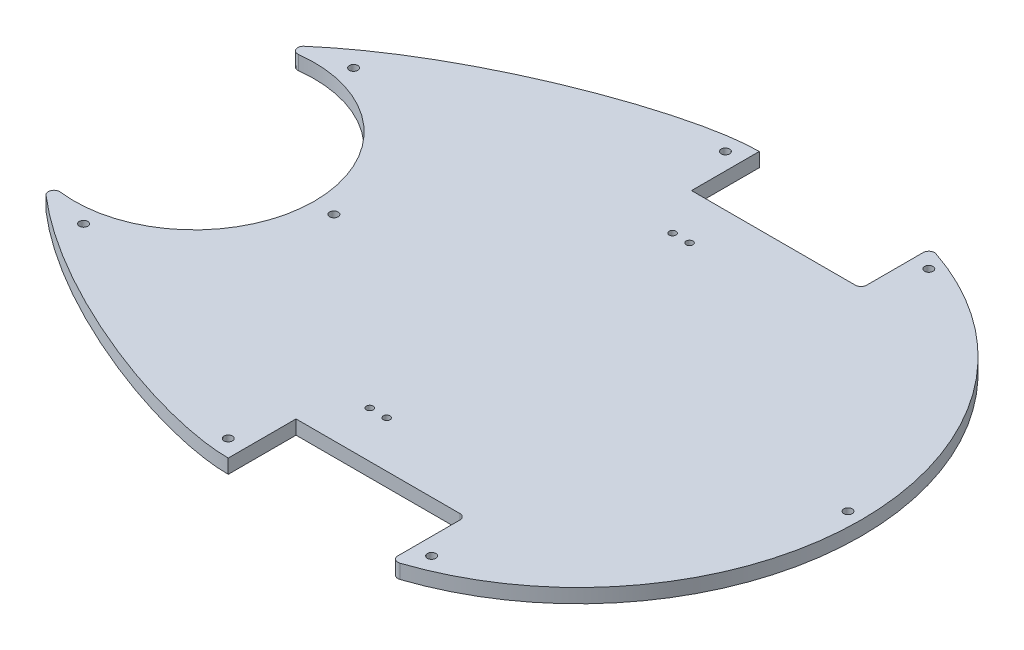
ISO-10303-21;
HEADER;
FILE_DESCRIPTION(('STEP AP214'),'2;1');
FILE_NAME('part.step','',(''),(''),'','','');
FILE_SCHEMA(('AUTOMOTIVE_DESIGN { 1 0 10303 214 1 1 1 1 }'));
ENDSEC;
DATA;
#1=APPLICATION_CONTEXT('core data for automotive mechanical design processes');
#2=APPLICATION_PROTOCOL_DEFINITION('international standard','automotive_design',2000,#1);
#3=PRODUCT_CONTEXT('',#1,'mechanical');
#4=PRODUCT('Part','Part','',(#3));
#5=PRODUCT_RELATED_PRODUCT_CATEGORY('part','',(#4));
#6=PRODUCT_DEFINITION_FORMATION('','',#4);
#7=PRODUCT_DEFINITION_CONTEXT('part definition',#1,'design');
#8=PRODUCT_DEFINITION('design','',#6,#7);
#9=PRODUCT_DEFINITION_SHAPE('','',#8);
#10=(LENGTH_UNIT() NAMED_UNIT(*) SI_UNIT(.MILLI.,.METRE.));
#11=(NAMED_UNIT(*) PLANE_ANGLE_UNIT() SI_UNIT($,.RADIAN.));
#12=(NAMED_UNIT(*) SI_UNIT($,.STERADIAN.) SOLID_ANGLE_UNIT());
#13=UNCERTAINTY_MEASURE_WITH_UNIT(LENGTH_MEASURE(1.E-05),#10,'distance_accuracy_value','');
#14=(GEOMETRIC_REPRESENTATION_CONTEXT(3) GLOBAL_UNCERTAINTY_ASSIGNED_CONTEXT((#13)) GLOBAL_UNIT_ASSIGNED_CONTEXT((#10,
#11,#12)) REPRESENTATION_CONTEXT('',''));
#15=CARTESIAN_POINT('',(0.,0.,0.));
#16=DIRECTION('',(0.,0.,1.));
#17=DIRECTION('',(1.,0.,0.));
#18=AXIS2_PLACEMENT_3D('',#15,#16,#17);
#19=CARTESIAN_POINT('',(37.4360125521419,6.35,-129.794919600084));
#20=CARTESIAN_POINT('',(-26.0639874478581,6.35,-129.794919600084));
#21=CARTESIAN_POINT('',(-212.753987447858,6.35,-40.894919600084));
#22=CARTESIAN_POINT('',(-212.753987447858,6.35,20.065080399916));
#23=CARTESIAN_POINT('',(-26.063987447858,6.35,108.965080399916));
#24=CARTESIAN_POINT('',(37.436012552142,6.35,108.965080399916));
#25=B_SPLINE_CURVE_WITH_KNOTS('',5,(#19,#20,#21,#22,#23,#24),.UNSPECIFIED.,.F.,.F.,(6,6),(0.,
1.),.UNSPECIFIED.);
#26=DIRECTION('',(0.,-1.,0.));
#27=VECTOR('',#26,1.);
#28=SURFACE_OF_LINEAR_EXTRUSION('',#25,#27);
#29=CARTESIAN_POINT('',(37.4360125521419,0.,-129.794919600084));
#30=CARTESIAN_POINT('',(-26.0639874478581,0.,-129.794919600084));
#31=CARTESIAN_POINT('',(-212.753987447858,0.,-40.894919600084));
#32=CARTESIAN_POINT('',(-212.753987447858,0.,20.065080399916));
#33=CARTESIAN_POINT('',(-26.063987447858,0.,108.965080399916));
#34=CARTESIAN_POINT('',(37.436012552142,0.,108.965080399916));
#35=B_SPLINE_CURVE_WITH_KNOTS('',5,(#29,#30,#31,#32,#33,#34),.UNSPECIFIED.,.F.,.F.,(6,6),(0.,
1.),.UNSPECIFIED.);
#36=CARTESIAN_POINT('',(37.4360125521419,0.,-129.794919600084));
#37=VERTEX_POINT('',#36);
#38=CARTESIAN_POINT('',(-105.87597551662,0.,-68.4108622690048));
#39=VERTEX_POINT('',#38);
#40=EDGE_CURVE('E167',#37,#39,#35,.T.);
#41=ORIENTED_EDGE('',*,*,#40,.T.);
#42=DIRECTION('',(0.,-1.,0.));
#43=VECTOR('',#42,1.);
#44=CARTESIAN_POINT('',(-105.87597551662,0.,-68.4108622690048));
#45=LINE('',#44,#43);
#46=CARTESIAN_POINT('',(-105.87597551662,6.35,-68.4108622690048));
#47=VERTEX_POINT('',#46);
#48=EDGE_CURVE('E11',#39,#47,#45,.F.);
#49=ORIENTED_EDGE('',*,*,#48,.T.);
#50=CARTESIAN_POINT('',(37.4360125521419,6.35,-129.794919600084));
#51=VERTEX_POINT('',#50);
#52=EDGE_CURVE('E197',#51,#47,#25,.T.);
#53=ORIENTED_EDGE('',*,*,#52,.F.);
#54=DIRECTION('',(0.,-1.,0.));
#55=VECTOR('',#54,1.);
#56=CARTESIAN_POINT('',(37.4360125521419,6.35,-129.794919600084));
#57=LINE('',#56,#55);
#58=EDGE_CURVE('E215',#51,#37,#57,.T.);
#59=ORIENTED_EDGE('',*,*,#58,.T.);
#60=EDGE_LOOP('',(#41,#49,#53,#59));
#61=FACE_BOUND('',#60,.T.);
#62=ADVANCED_FACE('F32',(#61),#28,.F.);
#63=CARTESIAN_POINT('',(37.4360125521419,6.35,78.485080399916));
#64=DIRECTION('',(-1.,0.,0.));
#65=DIRECTION('',(0.,0.,1.));
#66=AXIS2_PLACEMENT_3D('',#63,#64,#65);
#67=PLANE('',#66);
#68=DIRECTION('',(0.,0.,-1.));
#69=VECTOR('',#68,1.);
#70=CARTESIAN_POINT('',(37.4360125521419,0.,78.485080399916));
#71=LINE('',#70,#69);
#72=CARTESIAN_POINT('',(37.436012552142,0.,108.965080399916));
#73=VERTEX_POINT('',#72);
#74=CARTESIAN_POINT('',(37.4360125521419,0.,78.485080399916));
#75=VERTEX_POINT('',#74);
#76=EDGE_CURVE('E171',#73,#75,#71,.T.);
#77=ORIENTED_EDGE('',*,*,#76,.T.);
#78=DIRECTION('',(0.,-1.,0.));
#79=VECTOR('',#78,1.);
#80=CARTESIAN_POINT('',(37.4360125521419,6.35,78.485080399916));
#81=LINE('',#80,#79);
#82=CARTESIAN_POINT('',(37.4360125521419,6.35,78.485080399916));
#83=VERTEX_POINT('',#82);
#84=EDGE_CURVE('E151',#83,#75,#81,.T.);
#85=ORIENTED_EDGE('',*,*,#84,.F.);
#86=DIRECTION('',(0.,0.,-1.));
#87=VECTOR('',#86,1.);
#88=CARTESIAN_POINT('',(37.4360125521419,6.35,78.485080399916));
#89=LINE('',#88,#87);
#90=CARTESIAN_POINT('',(37.436012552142,6.35,108.965080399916));
#91=VERTEX_POINT('',#90);
#92=EDGE_CURVE('E158',#91,#83,#89,.T.);
#93=ORIENTED_EDGE('',*,*,#92,.F.);
#94=DIRECTION('',(0.,-1.,0.));
#95=VECTOR('',#94,1.);
#96=CARTESIAN_POINT('',(37.436012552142,6.35,108.965080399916));
#97=LINE('',#96,#95);
#98=EDGE_CURVE('E196',#91,#73,#97,.T.);
#99=ORIENTED_EDGE('',*,*,#98,.T.);
#100=EDGE_LOOP('',(#77,#85,#93,#99));
#101=FACE_BOUND('',#100,.T.);
#102=ADVANCED_FACE('F169',(#101),#67,.F.);
#103=CARTESIAN_POINT('',(37.4360125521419,6.35,78.485080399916));
#104=DIRECTION('',(0.,0.,-1.));
#105=DIRECTION('',(-1.,0.,0.));
#106=AXIS2_PLACEMENT_3D('',#103,#104,#105);
#107=PLANE('',#106);
#108=DIRECTION('',(1.,0.,0.));
#109=VECTOR('',#108,1.);
#110=CARTESIAN_POINT('',(37.4360125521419,0.,78.485080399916));
#111=LINE('',#110,#109);
#112=CARTESIAN_POINT('',(111.096012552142,0.,78.485080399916));
#113=VERTEX_POINT('',#112);
#114=EDGE_CURVE('E266',#75,#113,#111,.T.);
#115=ORIENTED_EDGE('',*,*,#114,.T.);
#116=DIRECTION('',(0.,-1.,0.));
#117=VECTOR('',#116,1.);
#118=CARTESIAN_POINT('',(111.096012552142,6.35,78.485080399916));
#119=LINE('',#118,#117);
#120=CARTESIAN_POINT('',(111.096012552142,6.35,78.485080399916));
#121=VERTEX_POINT('',#120);
#122=EDGE_CURVE('E154',#121,#113,#119,.T.);
#123=ORIENTED_EDGE('',*,*,#122,.F.);
#124=DIRECTION('',(1.,0.,0.));
#125=VECTOR('',#124,1.);
#126=CARTESIAN_POINT('',(37.4360125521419,6.35,78.485080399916));
#127=LINE('',#126,#125);
#128=EDGE_CURVE('E147',#83,#121,#127,.T.);
#129=ORIENTED_EDGE('',*,*,#128,.F.);
#130=ORIENTED_EDGE('',*,*,#84,.T.);
#131=EDGE_LOOP('',(#115,#123,#129,#130));
#132=FACE_BOUND('',#131,.T.);
#133=ADVANCED_FACE('F149',(#132),#107,.F.);
#134=CARTESIAN_POINT('',(111.096012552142,6.35,81.025080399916));
#135=DIRECTION('',(0.,-1.,0.));
#136=DIRECTION('',(0.,0.,-1.));
#137=AXIS2_PLACEMENT_3D('',#134,#135,#136);
#138=CYLINDRICAL_SURFACE('',#137,2.54);
#139=CARTESIAN_POINT('',(111.096012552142,0.,81.025080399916));
#140=DIRECTION('',(0.,-1.,0.));
#141=DIRECTION('',(0.,0.,-1.));
#142=AXIS2_PLACEMENT_3D('',#139,#140,#141);
#143=CIRCLE('',#142,2.54);
#144=CARTESIAN_POINT('',(113.636012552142,0.,81.025080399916));
#145=VERTEX_POINT('',#144);
#146=EDGE_CURVE('E260',#113,#145,#143,.T.);
#147=ORIENTED_EDGE('',*,*,#146,.T.);
#148=DIRECTION('',(0.,-1.,0.));
#149=VECTOR('',#148,1.);
#150=CARTESIAN_POINT('',(113.636012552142,6.35,81.025080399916));
#151=LINE('',#150,#149);
#152=CARTESIAN_POINT('',(113.636012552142,6.35,81.025080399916));
#153=VERTEX_POINT('',#152);
#154=EDGE_CURVE('E176',#153,#145,#151,.T.);
#155=ORIENTED_EDGE('',*,*,#154,.F.);
#156=CARTESIAN_POINT('',(111.096012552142,6.35,81.025080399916));
#157=DIRECTION('',(0.,-1.,0.));
#158=DIRECTION('',(0.,0.,-1.));
#159=AXIS2_PLACEMENT_3D('',#156,#157,#158);
#160=CIRCLE('',#159,2.54);
#161=EDGE_CURVE('E157',#121,#153,#160,.T.);
#162=ORIENTED_EDGE('',*,*,#161,.F.);
#163=ORIENTED_EDGE('',*,*,#122,.T.);
#164=EDGE_LOOP('',(#147,#155,#162,#163));
#165=FACE_BOUND('',#164,.T.);
#166=ADVANCED_FACE('F336',(#165),#138,.F.);
#167=CARTESIAN_POINT('',(113.636012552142,6.35,81.025080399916));
#168=DIRECTION('',(1.,0.,0.));
#169=DIRECTION('',(0.,0.,-1.));
#170=AXIS2_PLACEMENT_3D('',#167,#168,#169);
#171=PLANE('',#170);
#172=DIRECTION('',(0.,0.,1.));
#173=VECTOR('',#172,1.);
#174=CARTESIAN_POINT('',(113.636012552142,0.,81.025080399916));
#175=LINE('',#174,#173);
#176=CARTESIAN_POINT('',(113.636012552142,0.,108.883130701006));
#177=VERTEX_POINT('',#176);
#178=EDGE_CURVE('E255',#145,#177,#175,.T.);
#179=ORIENTED_EDGE('',*,*,#178,.T.);
#180=DIRECTION('',(0.,-1.,0.));
#181=VECTOR('',#180,1.);
#182=CARTESIAN_POINT('',(113.636012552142,6.35,108.883130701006));
#183=LINE('',#182,#181);
#184=CARTESIAN_POINT('',(113.636012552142,6.35,108.883130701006));
#185=VERTEX_POINT('',#184);
#186=EDGE_CURVE('E246',#185,#177,#183,.T.);
#187=ORIENTED_EDGE('',*,*,#186,.F.);
#188=DIRECTION('',(0.,0.,1.));
#189=VECTOR('',#188,1.);
#190=CARTESIAN_POINT('',(113.636012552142,6.35,81.025080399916));
#191=LINE('',#190,#189);
#192=EDGE_CURVE('E256',#153,#185,#191,.T.);
#193=ORIENTED_EDGE('',*,*,#192,.F.);
#194=ORIENTED_EDGE('',*,*,#154,.T.);
#195=EDGE_LOOP('',(#179,#187,#193,#194));
#196=FACE_BOUND('',#195,.T.);
#197=ADVANCED_FACE('F253',(#196),#171,.F.);
#198=CARTESIAN_POINT('',(116.176012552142,6.35,108.883130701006));
#199=DIRECTION('',(0.,-1.,0.));
#200=DIRECTION('',(0.,0.,-1.));
#201=AXIS2_PLACEMENT_3D('',#198,#199,#200);
#202=CYLINDRICAL_SURFACE('',#201,2.54);
#203=CARTESIAN_POINT('',(116.176012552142,0.,108.883130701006));
#204=DIRECTION('',(0.,1.,0.));
#205=DIRECTION('',(0.,0.,1.));
#206=AXIS2_PLACEMENT_3D('',#203,#204,#205);
#207=CIRCLE('',#206,2.54);
#208=CARTESIAN_POINT('',(116.979481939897,0.,111.292702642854));
#209=VERTEX_POINT('',#208);
#210=EDGE_CURVE('E262',#177,#209,#207,.T.);
#211=ORIENTED_EDGE('',*,*,#210,.T.);
#212=DIRECTION('',(0.,-1.,0.));
#213=VECTOR('',#212,1.);
#214=CARTESIAN_POINT('',(116.979481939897,6.35,111.292702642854));
#215=LINE('',#214,#213);
#216=CARTESIAN_POINT('',(116.979481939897,6.35,111.292702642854));
#217=VERTEX_POINT('',#216);
#218=EDGE_CURVE('E243',#217,#209,#215,.T.);
#219=ORIENTED_EDGE('',*,*,#218,.F.);
#220=CARTESIAN_POINT('',(116.176012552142,6.35,108.883130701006));
#221=DIRECTION('',(0.,1.,0.));
#222=DIRECTION('',(0.,0.,1.));
#223=AXIS2_PLACEMENT_3D('',#220,#221,#222);
#224=CIRCLE('',#223,2.54);
#225=EDGE_CURVE('E628',#185,#217,#224,.T.);
#226=ORIENTED_EDGE('',*,*,#225,.F.);
#227=ORIENTED_EDGE('',*,*,#186,.T.);
#228=EDGE_LOOP('',(#211,#219,#226,#227));
#229=FACE_BOUND('',#228,.T.);
#230=ADVANCED_FACE('F329',(#229),#202,.T.);
#231=CARTESIAN_POINT('',(76.806012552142,6.35,-9.18589444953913));
#232=DIRECTION('',(0.,-1.,0.));
#233=DIRECTION('',(0.,0.,-1.));
#234=AXIS2_PLACEMENT_3D('',#231,#232,#233);
#235=CYLINDRICAL_SURFACE('',#234,127.);
#236=CARTESIAN_POINT('',(76.806012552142,0.,-9.18589444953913));
#237=DIRECTION('',(0.,1.,0.));
#238=DIRECTION('',(0.,0.,1.));
#239=AXIS2_PLACEMENT_3D('',#236,#237,#238);
#240=CIRCLE('',#239,127.);
#241=CARTESIAN_POINT('',(116.979481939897,0.,-129.664491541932));
#242=VERTEX_POINT('',#241);
#243=EDGE_CURVE('E264',#209,#242,#240,.T.);
#244=ORIENTED_EDGE('',*,*,#243,.T.);
#245=DIRECTION('',(0.,-1.,0.));
#246=VECTOR('',#245,1.);
#247=CARTESIAN_POINT('',(116.979481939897,6.35,-129.664491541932));
#248=LINE('',#247,#246);
#249=CARTESIAN_POINT('',(116.979481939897,6.35,-129.664491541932));
#250=VERTEX_POINT('',#249);
#251=EDGE_CURVE('E240',#250,#242,#248,.T.);
#252=ORIENTED_EDGE('',*,*,#251,.F.);
#253=CARTESIAN_POINT('',(76.806012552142,6.35,-9.18589444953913));
#254=DIRECTION('',(0.,1.,0.));
#255=DIRECTION('',(0.,0.,1.));
#256=AXIS2_PLACEMENT_3D('',#253,#254,#255);
#257=CIRCLE('',#256,127.);
#258=EDGE_CURVE('E630',#217,#250,#257,.T.);
#259=ORIENTED_EDGE('',*,*,#258,.F.);
#260=ORIENTED_EDGE('',*,*,#218,.T.);
#261=EDGE_LOOP('',(#244,#252,#259,#260));
#262=FACE_BOUND('',#261,.T.);
#263=ADVANCED_FACE('F325',(#262),#235,.T.);
#264=CARTESIAN_POINT('',(116.176012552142,6.35,-127.254919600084));
#265=DIRECTION('',(0.,-1.,0.));
#266=DIRECTION('',(0.,0.,-1.));
#267=AXIS2_PLACEMENT_3D('',#264,#265,#266);
#268=CYLINDRICAL_SURFACE('',#267,2.54000000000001);
#269=CARTESIAN_POINT('',(116.176012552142,0.,-127.254919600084));
#270=DIRECTION('',(0.,1.,0.));
#271=DIRECTION('',(0.,0.,-1.));
#272=AXIS2_PLACEMENT_3D('',#269,#270,#271);
#273=CIRCLE('',#272,2.54000000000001);
#274=CARTESIAN_POINT('',(113.636012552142,0.,-127.254919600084));
#275=VERTEX_POINT('',#274);
#276=EDGE_CURVE('E271',#242,#275,#273,.T.);
#277=ORIENTED_EDGE('',*,*,#276,.T.);
#278=DIRECTION('',(0.,-1.,0.));
#279=VECTOR('',#278,1.);
#280=CARTESIAN_POINT('',(113.636012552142,6.35,-127.254919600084));
#281=LINE('',#280,#279);
#282=CARTESIAN_POINT('',(113.636012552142,6.35,-127.254919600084));
#283=VERTEX_POINT('',#282);
#284=EDGE_CURVE('E237',#283,#275,#281,.T.);
#285=ORIENTED_EDGE('',*,*,#284,.F.);
#286=CARTESIAN_POINT('',(116.176012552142,6.35,-127.254919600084));
#287=DIRECTION('',(0.,1.,0.));
#288=DIRECTION('',(0.,0.,-1.));
#289=AXIS2_PLACEMENT_3D('',#286,#287,#288);
#290=CIRCLE('',#289,2.54000000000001);
#291=EDGE_CURVE('E632',#250,#283,#290,.T.);
#292=ORIENTED_EDGE('',*,*,#291,.F.);
#293=ORIENTED_EDGE('',*,*,#251,.T.);
#294=EDGE_LOOP('',(#277,#285,#292,#293));
#295=FACE_BOUND('',#294,.T.);
#296=ADVANCED_FACE('F321',(#295),#268,.T.);
#297=CARTESIAN_POINT('',(113.636012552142,6.35,-127.254919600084));
#298=DIRECTION('',(1.,0.,0.));
#299=DIRECTION('',(0.,0.,-1.));
#300=AXIS2_PLACEMENT_3D('',#297,#298,#299);
#301=PLANE('',#300);
#302=DIRECTION('',(0.,0.,1.));
#303=VECTOR('',#302,1.);
#304=CARTESIAN_POINT('',(113.636012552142,0.,-127.254919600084));
#305=LINE('',#304,#303);
#306=CARTESIAN_POINT('',(113.636012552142,0.,-101.854919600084));
#307=VERTEX_POINT('',#306);
#308=EDGE_CURVE('E273',#275,#307,#305,.T.);
#309=ORIENTED_EDGE('',*,*,#308,.T.);
#310=DIRECTION('',(0.,-1.,0.));
#311=VECTOR('',#310,1.);
#312=CARTESIAN_POINT('',(113.636012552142,6.35,-101.854919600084));
#313=LINE('',#312,#311);
#314=CARTESIAN_POINT('',(113.636012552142,6.35,-101.854919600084));
#315=VERTEX_POINT('',#314);
#316=EDGE_CURVE('E234',#315,#307,#313,.T.);
#317=ORIENTED_EDGE('',*,*,#316,.F.);
#318=DIRECTION('',(0.,0.,1.));
#319=VECTOR('',#318,1.);
#320=CARTESIAN_POINT('',(113.636012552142,6.35,-127.254919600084));
#321=LINE('',#320,#319);
#322=EDGE_CURVE('E297',#283,#315,#321,.T.);
#323=ORIENTED_EDGE('',*,*,#322,.F.);
#324=ORIENTED_EDGE('',*,*,#284,.T.);
#325=EDGE_LOOP('',(#309,#317,#323,#324));
#326=FACE_BOUND('',#325,.T.);
#327=ADVANCED_FACE('F318',(#326),#301,.F.);
#328=CARTESIAN_POINT('',(111.096012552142,6.35,-101.854919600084));
#329=DIRECTION('',(0.,-1.,0.));
#330=DIRECTION('',(0.,0.,-1.));
#331=AXIS2_PLACEMENT_3D('',#328,#329,#330);
#332=CYLINDRICAL_SURFACE('',#331,2.54000000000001);
#333=CARTESIAN_POINT('',(111.096012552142,0.,-101.854919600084));
#334=DIRECTION('',(0.,-1.,0.));
#335=DIRECTION('',(0.,0.,1.));
#336=AXIS2_PLACEMENT_3D('',#333,#334,#335);
#337=CIRCLE('',#336,2.54000000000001);
#338=CARTESIAN_POINT('',(111.096012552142,0.,-99.314919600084));
#339=VERTEX_POINT('',#338);
#340=EDGE_CURVE('E275',#307,#339,#337,.T.);
#341=ORIENTED_EDGE('',*,*,#340,.T.);
#342=DIRECTION('',(0.,-1.,0.));
#343=VECTOR('',#342,1.);
#344=CARTESIAN_POINT('',(111.096012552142,6.35,-99.314919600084));
#345=LINE('',#344,#343);
#346=CARTESIAN_POINT('',(111.096012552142,6.35,-99.314919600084));
#347=VERTEX_POINT('',#346);
#348=EDGE_CURVE('E231',#347,#339,#345,.T.);
#349=ORIENTED_EDGE('',*,*,#348,.F.);
#350=CARTESIAN_POINT('',(111.096012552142,6.35,-101.854919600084));
#351=DIRECTION('',(0.,-1.,0.));
#352=DIRECTION('',(0.,0.,1.));
#353=AXIS2_PLACEMENT_3D('',#350,#351,#352);
#354=CIRCLE('',#353,2.54000000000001);
#355=EDGE_CURVE('E294',#315,#347,#354,.T.);
#356=ORIENTED_EDGE('',*,*,#355,.F.);
#357=ORIENTED_EDGE('',*,*,#316,.T.);
#358=EDGE_LOOP('',(#341,#349,#356,#357));
#359=FACE_BOUND('',#358,.T.);
#360=ADVANCED_FACE('F288',(#359),#332,.F.);
#361=CARTESIAN_POINT('',(37.436012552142,6.35,-99.314919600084));
#362=DIRECTION('',(0.,0.,1.));
#363=DIRECTION('',(1.,0.,0.));
#364=AXIS2_PLACEMENT_3D('',#361,#362,#363);
#365=PLANE('',#364);
#366=DIRECTION('',(-1.,0.,0.));
#367=VECTOR('',#366,1.);
#368=CARTESIAN_POINT('',(37.436012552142,0.,-99.314919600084));
#369=LINE('',#368,#367);
#370=CARTESIAN_POINT('',(37.436012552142,0.,-99.314919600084));
#371=VERTEX_POINT('',#370);
#372=EDGE_CURVE('E276',#339,#371,#369,.T.);
#373=ORIENTED_EDGE('',*,*,#372,.T.);
#374=DIRECTION('',(0.,-1.,0.));
#375=VECTOR('',#374,1.);
#376=CARTESIAN_POINT('',(37.436012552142,6.35,-99.314919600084));
#377=LINE('',#376,#375);
#378=CARTESIAN_POINT('',(37.436012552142,6.35,-99.314919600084));
#379=VERTEX_POINT('',#378);
#380=EDGE_CURVE('E228',#379,#371,#377,.T.);
#381=ORIENTED_EDGE('',*,*,#380,.F.);
#382=DIRECTION('',(-1.,0.,0.));
#383=VECTOR('',#382,1.);
#384=CARTESIAN_POINT('',(37.436012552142,6.35,-99.314919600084));
#385=LINE('',#384,#383);
#386=EDGE_CURVE('E293',#347,#379,#385,.T.);
#387=ORIENTED_EDGE('',*,*,#386,.F.);
#388=ORIENTED_EDGE('',*,*,#348,.T.);
#389=EDGE_LOOP('',(#373,#381,#387,#388));
#390=FACE_BOUND('',#389,.T.);
#391=ADVANCED_FACE('F292',(#390),#365,.F.);
#392=CARTESIAN_POINT('',(37.436012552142,6.35,-99.314919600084));
#393=DIRECTION('',(-1.,0.,0.));
#394=DIRECTION('',(0.,0.,1.));
#395=AXIS2_PLACEMENT_3D('',#392,#393,#394);
#396=PLANE('',#395);
#397=DIRECTION('',(0.,0.,-1.));
#398=VECTOR('',#397,1.);
#399=CARTESIAN_POINT('',(37.436012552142,0.,-99.314919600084));
#400=LINE('',#399,#398);
#401=EDGE_CURVE('E217',#371,#37,#400,.T.);
#402=ORIENTED_EDGE('',*,*,#401,.T.);
#403=ORIENTED_EDGE('',*,*,#58,.F.);
#404=DIRECTION('',(0.,0.,-1.));
#405=VECTOR('',#404,1.);
#406=CARTESIAN_POINT('',(37.436012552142,6.35,-99.314919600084));
#407=LINE('',#406,#405);
#408=EDGE_CURVE('E198',#379,#51,#407,.T.);
#409=ORIENTED_EDGE('',*,*,#408,.F.);
#410=ORIENTED_EDGE('',*,*,#380,.T.);
#411=EDGE_LOOP('',(#402,#403,#409,#410));
#412=FACE_BOUND('',#411,.T.);
#413=ADVANCED_FACE('F281',(#412),#396,.F.);
#414=CARTESIAN_POINT('',(-105.87597551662,6.35,47.5810230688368));
#415=VERTEX_POINT('',#414);
#416=EDGE_CURVE('E163',#415,#91,#25,.T.);
#417=ORIENTED_EDGE('',*,*,#416,.F.);
#418=DIRECTION('',(0.,-1.,0.));
#419=VECTOR('',#418,1.);
#420=CARTESIAN_POINT('',(-105.87597551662,6.35,47.5810230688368));
#421=LINE('',#420,#419);
#422=CARTESIAN_POINT('',(-105.87597551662,0.,47.5810230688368));
#423=VERTEX_POINT('',#422);
#424=EDGE_CURVE('E174',#415,#423,#421,.T.);
#425=ORIENTED_EDGE('',*,*,#424,.T.);
#426=EDGE_CURVE('E205',#423,#73,#35,.T.);
#427=ORIENTED_EDGE('',*,*,#426,.T.);
#428=ORIENTED_EDGE('',*,*,#98,.F.);
#429=EDGE_LOOP('',(#417,#425,#427,#428));
#430=FACE_BOUND('',#429,.T.);
#431=ADVANCED_FACE('F194',(#430),#28,.F.);
#432=CARTESIAN_POINT('',(-138.776487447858,6.35,-10.414919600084));
#433=DIRECTION('',(0.,-1.,0.));
#434=DIRECTION('',(0.,0.,-1.));
#435=AXIS2_PLACEMENT_3D('',#432,#433,#434);
#436=PLANE('',#435);
#437=CARTESIAN_POINT('',(49.7550125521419,6.35,57.657080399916));
#438=DIRECTION('',(0.,-1.,0.));
#439=DIRECTION('',(0.,0.,-1.));
#440=AXIS2_PLACEMENT_3D('',#437,#438,#439);
#441=CIRCLE('',#440,1.524);
#442=CARTESIAN_POINT('',(49.7550125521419,6.35,56.133080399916));
#443=VERTEX_POINT('',#442);
#444=EDGE_CURVE('E552',#443,#443,#441,.T.);
#445=ORIENTED_EDGE('',*,*,#444,.T.);
#446=EDGE_LOOP('',(#445));
#447=FACE_BOUND('',#446,.T.);
#448=CARTESIAN_POINT('',(49.755012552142,6.35,-78.486919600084));
#449=DIRECTION('',(0.,-1.,0.));
#450=DIRECTION('',(0.,0.,-1.));
#451=AXIS2_PLACEMENT_3D('',#448,#449,#450);
#452=CIRCLE('',#451,1.524);
#453=CARTESIAN_POINT('',(49.755012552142,6.35,-80.010919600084));
#454=VERTEX_POINT('',#453);
#455=EDGE_CURVE('E556',#454,#454,#452,.T.);
#456=ORIENTED_EDGE('',*,*,#455,.T.);
#457=EDGE_LOOP('',(#456));
#458=FACE_BOUND('',#457,.T.);
#459=CARTESIAN_POINT('',(57.375012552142,6.35,-78.486919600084));
#460=DIRECTION('',(0.,-1.,0.));
#461=DIRECTION('',(0.,0.,-1.));
#462=AXIS2_PLACEMENT_3D('',#459,#460,#461);
#463=CIRCLE('',#462,1.524);
#464=CARTESIAN_POINT('',(57.375012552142,6.35,-80.010919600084));
#465=VERTEX_POINT('',#464);
#466=EDGE_CURVE('E566',#465,#465,#463,.T.);
#467=ORIENTED_EDGE('',*,*,#466,.T.);
#468=EDGE_LOOP('',(#467));
#469=FACE_BOUND('',#468,.T.);
#470=CARTESIAN_POINT('',(57.3750125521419,6.35,57.657080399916));
#471=DIRECTION('',(0.,-1.,0.));
#472=DIRECTION('',(0.,0.,-1.));
#473=AXIS2_PLACEMENT_3D('',#470,#471,#472);
#474=CIRCLE('',#473,1.524);
#475=CARTESIAN_POINT('',(57.3750125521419,6.35,56.133080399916));
#476=VERTEX_POINT('',#475);
#477=EDGE_CURVE('E572',#476,#476,#474,.T.);
#478=ORIENTED_EDGE('',*,*,#477,.T.);
#479=EDGE_LOOP('',(#478));
#480=FACE_BOUND('',#479,.T.);
#481=CARTESIAN_POINT('',(-33.683987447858,6.35,-9.65291960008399));
#482=DIRECTION('',(0.,1.,0.));
#483=DIRECTION('',(0.,0.,1.));
#484=AXIS2_PLACEMENT_3D('',#481,#482,#483);
#485=CIRCLE('',#484,1.905);
#486=CARTESIAN_POINT('',(-33.683987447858,6.35,-7.74791960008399));
#487=VERTEX_POINT('',#486);
#488=EDGE_CURVE('E575',#487,#487,#485,.T.);
#489=ORIENTED_EDGE('',*,*,#488,.F.);
#490=EDGE_LOOP('',(#489));
#491=FACE_BOUND('',#490,.T.);
#492=CARTESIAN_POINT('',(197.456012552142,6.35,-9.65291960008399));
#493=DIRECTION('',(0.,1.,0.));
#494=DIRECTION('',(0.,0.,1.));
#495=AXIS2_PLACEMENT_3D('',#492,#493,#494);
#496=CIRCLE('',#495,1.90499999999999);
#497=CARTESIAN_POINT('',(197.456012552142,6.35,-7.747919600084));
#498=VERTEX_POINT('',#497);
#499=EDGE_CURVE('E594',#498,#498,#496,.T.);
#500=ORIENTED_EDGE('',*,*,#499,.F.);
#501=EDGE_LOOP('',(#500));
#502=FACE_BOUND('',#501,.T.);
#503=CARTESIAN_POINT('',(-86.2919229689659,6.35,-71.120919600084));
#504=DIRECTION('',(0.,1.,0.));
#505=DIRECTION('',(0.,0.,1.));
#506=AXIS2_PLACEMENT_3D('',#503,#504,#505);
#507=CIRCLE('',#506,1.90500000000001);
#508=CARTESIAN_POINT('',(-86.2919229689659,6.35,-69.215919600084));
#509=VERTEX_POINT('',#508);
#510=EDGE_CURVE('E588',#509,#509,#507,.T.);
#511=ORIENTED_EDGE('',*,*,#510,.F.);
#512=EDGE_LOOP('',(#511));
#513=FACE_BOUND('',#512,.T.);
#514=CARTESIAN_POINT('',(-86.2919229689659,6.35,50.291080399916));
#515=DIRECTION('',(0.,1.,0.));
#516=DIRECTION('',(0.,0.,1.));
#517=AXIS2_PLACEMENT_3D('',#514,#515,#516);
#518=CIRCLE('',#517,1.90500000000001);
#519=CARTESIAN_POINT('',(-86.2919229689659,6.35,52.196080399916));
#520=VERTEX_POINT('',#519);
#521=EDGE_CURVE('E582',#520,#520,#518,.T.);
#522=ORIENTED_EDGE('',*,*,#521,.F.);
#523=EDGE_LOOP('',(#522));
#524=FACE_BOUND('',#523,.T.);
#525=CARTESIAN_POINT('',(29.816012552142,6.35,101.345080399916));
#526=DIRECTION('',(0.,1.,0.));
#527=DIRECTION('',(0.,0.,1.));
#528=AXIS2_PLACEMENT_3D('',#525,#526,#527);
#529=CIRCLE('',#528,1.905);
#530=CARTESIAN_POINT('',(29.816012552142,6.35,103.250080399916));
#531=VERTEX_POINT('',#530);
#532=EDGE_CURVE('E581',#531,#531,#529,.T.);
#533=ORIENTED_EDGE('',*,*,#532,.F.);
#534=EDGE_LOOP('',(#533));
#535=FACE_BOUND('',#534,.T.);
#536=CARTESIAN_POINT('',(29.816012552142,6.35,-122.174919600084));
#537=DIRECTION('',(0.,1.,0.));
#538=DIRECTION('',(0.,0.,1.));
#539=AXIS2_PLACEMENT_3D('',#536,#537,#538);
#540=CIRCLE('',#539,1.905);
#541=CARTESIAN_POINT('',(29.816012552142,6.35,-120.269919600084));
#542=VERTEX_POINT('',#541);
#543=EDGE_CURVE('E612',#542,#542,#540,.T.);
#544=ORIENTED_EDGE('',*,*,#543,.F.);
#545=EDGE_LOOP('',(#544));
#546=FACE_BOUND('',#545,.T.);
#547=CARTESIAN_POINT('',(121.256012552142,6.35,-122.174919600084));
#548=DIRECTION('',(0.,1.,0.));
#549=DIRECTION('',(0.,0.,1.));
#550=AXIS2_PLACEMENT_3D('',#547,#548,#549);
#551=CIRCLE('',#550,1.90500000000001);
#552=CARTESIAN_POINT('',(121.256012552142,6.35,-120.269919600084));
#553=VERTEX_POINT('',#552);
#554=EDGE_CURVE('E606',#553,#553,#551,.T.);
#555=ORIENTED_EDGE('',*,*,#554,.F.);
#556=EDGE_LOOP('',(#555));
#557=FACE_BOUND('',#556,.T.);
#558=CARTESIAN_POINT('',(121.256012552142,6.35,101.345080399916));
#559=DIRECTION('',(0.,1.,0.));
#560=DIRECTION('',(0.,0.,1.));
#561=AXIS2_PLACEMENT_3D('',#558,#559,#560);
#562=CIRCLE('',#561,1.90500000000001);
#563=CARTESIAN_POINT('',(121.256012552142,6.35,103.250080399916));
#564=VERTEX_POINT('',#563);
#565=EDGE_CURVE('E605',#564,#564,#562,.T.);
#566=ORIENTED_EDGE('',*,*,#565,.F.);
#567=EDGE_LOOP('',(#566));
#568=FACE_BOUND('',#567,.T.);
#569=CARTESIAN_POINT('',(-97.183987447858,6.35,-10.414919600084));
#570=DIRECTION('',(0.,-1.,0.));
#571=DIRECTION('',(0.,0.,-1.));
#572=AXIS2_PLACEMENT_3D('',#569,#570,#571);
#573=CIRCLE('',#572,53.975);
#574=CARTESIAN_POINT('',(-103.896877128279,6.35,-63.9708505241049));
#575=VERTEX_POINT('',#574);
#576=CARTESIAN_POINT('',(-103.896877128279,6.35,43.1410113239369));
#577=VERTEX_POINT('',#576);
#578=EDGE_CURVE('E190',#575,#577,#573,.T.);
#579=ORIENTED_EDGE('',*,*,#578,.T.);
#580=CARTESIAN_POINT('',(-104.212777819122,6.35,45.6612904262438));
#581=DIRECTION('',(0.,-1.,0.));
#582=DIRECTION('',(0.,0.,-1.));
#583=AXIS2_PLACEMENT_3D('',#580,#581,#582);
#584=CIRCLE('',#583,2.54);
#585=EDGE_CURVE('E40',#577,#415,#584,.F.);
#586=ORIENTED_EDGE('',*,*,#585,.T.);
#587=ORIENTED_EDGE('',*,*,#416,.T.);
#588=ORIENTED_EDGE('',*,*,#92,.T.);
#589=ORIENTED_EDGE('',*,*,#128,.T.);
#590=ORIENTED_EDGE('',*,*,#161,.T.);
#591=ORIENTED_EDGE('',*,*,#192,.T.);
#592=ORIENTED_EDGE('',*,*,#225,.T.);
#593=ORIENTED_EDGE('',*,*,#258,.T.);
#594=ORIENTED_EDGE('',*,*,#291,.T.);
#595=ORIENTED_EDGE('',*,*,#322,.T.);
#596=ORIENTED_EDGE('',*,*,#355,.T.);
#597=ORIENTED_EDGE('',*,*,#386,.T.);
#598=ORIENTED_EDGE('',*,*,#408,.T.);
#599=ORIENTED_EDGE('',*,*,#52,.T.);
#600=CARTESIAN_POINT('',(-104.212777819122,6.35,-66.4911296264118));
#601=DIRECTION('',(0.,-1.,0.));
#602=DIRECTION('',(0.,0.,-1.));
#603=AXIS2_PLACEMENT_3D('',#600,#601,#602);
#604=CIRCLE('',#603,2.54);
#605=EDGE_CURVE('E47',#47,#575,#604,.F.);
#606=ORIENTED_EDGE('',*,*,#605,.T.);
#607=EDGE_LOOP('',(#579,#586,#587,#588,#589,#590,#591,#592,#593,#594,#595,#596,#597,#598,#599,#606));
#608=FACE_BOUND('',#607,.T.);
#609=ADVANCED_FACE('F161',(#447,#458,#469,#480,#491,#502,#513,#524,#535,#546,#557,#568,#608),
#436,.F.);
#610=CARTESIAN_POINT('',(-138.776487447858,0.,-10.414919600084));
#611=DIRECTION('',(0.,-1.,0.));
#612=DIRECTION('',(0.,0.,-1.));
#613=AXIS2_PLACEMENT_3D('',#610,#611,#612);
#614=PLANE('',#613);
#615=CARTESIAN_POINT('',(49.7550125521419,0.,57.657080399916));
#616=DIRECTION('',(0.,-1.,0.));
#617=DIRECTION('',(0.,0.,-1.));
#618=AXIS2_PLACEMENT_3D('',#615,#616,#617);
#619=CIRCLE('',#618,1.524);
#620=CARTESIAN_POINT('',(49.7550125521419,0.,56.133080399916));
#621=VERTEX_POINT('',#620);
#622=EDGE_CURVE('E555',#621,#621,#619,.T.);
#623=ORIENTED_EDGE('',*,*,#622,.F.);
#624=EDGE_LOOP('',(#623));
#625=FACE_BOUND('',#624,.T.);
#626=CARTESIAN_POINT('',(49.755012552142,0.,-78.486919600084));
#627=DIRECTION('',(0.,-1.,0.));
#628=DIRECTION('',(0.,0.,-1.));
#629=AXIS2_PLACEMENT_3D('',#626,#627,#628);
#630=CIRCLE('',#629,1.524);
#631=CARTESIAN_POINT('',(49.755012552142,0.,-80.010919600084));
#632=VERTEX_POINT('',#631);
#633=EDGE_CURVE('E561',#632,#632,#630,.T.);
#634=ORIENTED_EDGE('',*,*,#633,.F.);
#635=EDGE_LOOP('',(#634));
#636=FACE_BOUND('',#635,.T.);
#637=CARTESIAN_POINT('',(57.375012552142,0.,-78.486919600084));
#638=DIRECTION('',(0.,-1.,0.));
#639=DIRECTION('',(0.,0.,-1.));
#640=AXIS2_PLACEMENT_3D('',#637,#638,#639);
#641=CIRCLE('',#640,1.524);
#642=CARTESIAN_POINT('',(57.375012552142,0.,-80.010919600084));
#643=VERTEX_POINT('',#642);
#644=EDGE_CURVE('E569',#643,#643,#641,.T.);
#645=ORIENTED_EDGE('',*,*,#644,.F.);
#646=EDGE_LOOP('',(#645));
#647=FACE_BOUND('',#646,.T.);
#648=CARTESIAN_POINT('',(57.3750125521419,0.,57.657080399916));
#649=DIRECTION('',(0.,-1.,0.));
#650=DIRECTION('',(0.,0.,-1.));
#651=AXIS2_PLACEMENT_3D('',#648,#649,#650);
#652=CIRCLE('',#651,1.524);
#653=CARTESIAN_POINT('',(57.3750125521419,0.,56.133080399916));
#654=VERTEX_POINT('',#653);
#655=EDGE_CURVE('E558',#654,#654,#652,.T.);
#656=ORIENTED_EDGE('',*,*,#655,.F.);
#657=EDGE_LOOP('',(#656));
#658=FACE_BOUND('',#657,.T.);
#659=CARTESIAN_POINT('',(-33.683987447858,0.,-9.65291960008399));
#660=DIRECTION('',(0.,1.,0.));
#661=DIRECTION('',(0.,0.,1.));
#662=AXIS2_PLACEMENT_3D('',#659,#660,#661);
#663=CIRCLE('',#662,1.905);
#664=CARTESIAN_POINT('',(-33.683987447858,0.,-7.74791960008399));
#665=VERTEX_POINT('',#664);
#666=EDGE_CURVE('E597',#665,#665,#663,.T.);
#667=ORIENTED_EDGE('',*,*,#666,.T.);
#668=EDGE_LOOP('',(#667));
#669=FACE_BOUND('',#668,.T.);
#670=CARTESIAN_POINT('',(197.456012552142,0.,-9.65291960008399));
#671=DIRECTION('',(0.,1.,0.));
#672=DIRECTION('',(0.,0.,1.));
#673=AXIS2_PLACEMENT_3D('',#670,#671,#672);
#674=CIRCLE('',#673,1.90499999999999);
#675=CARTESIAN_POINT('',(197.456012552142,0.,-7.747919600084));
#676=VERTEX_POINT('',#675);
#677=EDGE_CURVE('E591',#676,#676,#674,.T.);
#678=ORIENTED_EDGE('',*,*,#677,.T.);
#679=EDGE_LOOP('',(#678));
#680=FACE_BOUND('',#679,.T.);
#681=CARTESIAN_POINT('',(-86.2919229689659,0.,-71.120919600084));
#682=DIRECTION('',(0.,1.,0.));
#683=DIRECTION('',(0.,0.,1.));
#684=AXIS2_PLACEMENT_3D('',#681,#682,#683);
#685=CIRCLE('',#684,1.90500000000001);
#686=CARTESIAN_POINT('',(-86.2919229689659,0.,-69.215919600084));
#687=VERTEX_POINT('',#686);
#688=EDGE_CURVE('E585',#687,#687,#685,.T.);
#689=ORIENTED_EDGE('',*,*,#688,.T.);
#690=EDGE_LOOP('',(#689));
#691=FACE_BOUND('',#690,.T.);
#692=CARTESIAN_POINT('',(-86.2919229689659,0.,50.291080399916));
#693=DIRECTION('',(0.,1.,0.));
#694=DIRECTION('',(0.,0.,1.));
#695=AXIS2_PLACEMENT_3D('',#692,#693,#694);
#696=CIRCLE('',#695,1.90500000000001);
#697=CARTESIAN_POINT('',(-86.2919229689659,0.,52.196080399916));
#698=VERTEX_POINT('',#697);
#699=EDGE_CURVE('E578',#698,#698,#696,.T.);
#700=ORIENTED_EDGE('',*,*,#699,.T.);
#701=EDGE_LOOP('',(#700));
#702=FACE_BOUND('',#701,.T.);
#703=CARTESIAN_POINT('',(29.816012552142,0.,101.345080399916));
#704=DIRECTION('',(0.,1.,0.));
#705=DIRECTION('',(0.,0.,1.));
#706=AXIS2_PLACEMENT_3D('',#703,#704,#705);
#707=CIRCLE('',#706,1.905);
#708=CARTESIAN_POINT('',(29.816012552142,0.,103.250080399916));
#709=VERTEX_POINT('',#708);
#710=EDGE_CURVE('E615',#709,#709,#707,.T.);
#711=ORIENTED_EDGE('',*,*,#710,.T.);
#712=EDGE_LOOP('',(#711));
#713=FACE_BOUND('',#712,.T.);
#714=CARTESIAN_POINT('',(29.816012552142,0.,-122.174919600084));
#715=DIRECTION('',(0.,1.,0.));
#716=DIRECTION('',(0.,0.,1.));
#717=AXIS2_PLACEMENT_3D('',#714,#715,#716);
#718=CIRCLE('',#717,1.905);
#719=CARTESIAN_POINT('',(29.816012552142,0.,-120.269919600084));
#720=VERTEX_POINT('',#719);
#721=EDGE_CURVE('E609',#720,#720,#718,.T.);
#722=ORIENTED_EDGE('',*,*,#721,.T.);
#723=EDGE_LOOP('',(#722));
#724=FACE_BOUND('',#723,.T.);
#725=CARTESIAN_POINT('',(121.256012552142,0.,-122.174919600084));
#726=DIRECTION('',(0.,1.,0.));
#727=DIRECTION('',(0.,0.,1.));
#728=AXIS2_PLACEMENT_3D('',#725,#726,#727);
#729=CIRCLE('',#728,1.90500000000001);
#730=CARTESIAN_POINT('',(121.256012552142,0.,-120.269919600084));
#731=VERTEX_POINT('',#730);
#732=EDGE_CURVE('E602',#731,#731,#729,.T.);
#733=ORIENTED_EDGE('',*,*,#732,.T.);
#734=EDGE_LOOP('',(#733));
#735=FACE_BOUND('',#734,.T.);
#736=CARTESIAN_POINT('',(121.256012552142,0.,101.345080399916));
#737=DIRECTION('',(0.,1.,0.));
#738=DIRECTION('',(0.,0.,1.));
#739=AXIS2_PLACEMENT_3D('',#736,#737,#738);
#740=CIRCLE('',#739,1.90500000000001);
#741=CARTESIAN_POINT('',(121.256012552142,0.,103.250080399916));
#742=VERTEX_POINT('',#741);
#743=EDGE_CURVE('E620',#742,#742,#740,.T.);
#744=ORIENTED_EDGE('',*,*,#743,.T.);
#745=EDGE_LOOP('',(#744));
#746=FACE_BOUND('',#745,.T.);
#747=ORIENTED_EDGE('',*,*,#426,.F.);
#748=CARTESIAN_POINT('',(-104.212777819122,0.,45.6612904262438));
#749=DIRECTION('',(0.,-1.,0.));
#750=DIRECTION('',(0.,0.,-1.));
#751=AXIS2_PLACEMENT_3D('',#748,#749,#750);
#752=CIRCLE('',#751,2.54);
#753=CARTESIAN_POINT('',(-103.896877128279,0.,43.1410113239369));
#754=VERTEX_POINT('',#753);
#755=EDGE_CURVE('E184',#423,#754,#752,.T.);
#756=ORIENTED_EDGE('',*,*,#755,.T.);
#757=CARTESIAN_POINT('',(-97.183987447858,0.,-10.414919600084));
#758=DIRECTION('',(0.,-1.,0.));
#759=DIRECTION('',(0.,0.,-1.));
#760=AXIS2_PLACEMENT_3D('',#757,#758,#759);
#761=CIRCLE('',#760,53.975);
#762=CARTESIAN_POINT('',(-103.896877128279,0.,-63.9708505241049));
#763=VERTEX_POINT('',#762);
#764=EDGE_CURVE('E172',#763,#754,#761,.T.);
#765=ORIENTED_EDGE('',*,*,#764,.F.);
#766=CARTESIAN_POINT('',(-104.212777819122,0.,-66.4911296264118));
#767=DIRECTION('',(0.,-1.,0.));
#768=DIRECTION('',(0.,0.,-1.));
#769=AXIS2_PLACEMENT_3D('',#766,#767,#768);
#770=CIRCLE('',#769,2.54);
#771=EDGE_CURVE('E182',#763,#39,#770,.T.);
#772=ORIENTED_EDGE('',*,*,#771,.T.);
#773=ORIENTED_EDGE('',*,*,#40,.F.);
#774=ORIENTED_EDGE('',*,*,#401,.F.);
#775=ORIENTED_EDGE('',*,*,#372,.F.);
#776=ORIENTED_EDGE('',*,*,#340,.F.);
#777=ORIENTED_EDGE('',*,*,#308,.F.);
#778=ORIENTED_EDGE('',*,*,#276,.F.);
#779=ORIENTED_EDGE('',*,*,#243,.F.);
#780=ORIENTED_EDGE('',*,*,#210,.F.);
#781=ORIENTED_EDGE('',*,*,#178,.F.);
#782=ORIENTED_EDGE('',*,*,#146,.F.);
#783=ORIENTED_EDGE('',*,*,#114,.F.);
#784=ORIENTED_EDGE('',*,*,#76,.F.);
#785=EDGE_LOOP('',(#747,#756,#765,#772,#773,#774,#775,#776,#777,#778,#779,#780,#781,#782,#783,#784));
#786=FACE_BOUND('',#785,.T.);
#787=ADVANCED_FACE('F203',(#625,#636,#647,#658,#669,#680,#691,#702,#713,#724,#735,#746,#786),
#614,.T.);
#788=CARTESIAN_POINT('',(-97.183987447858,6.35,-10.414919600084));
#789=DIRECTION('',(0.,-1.,0.));
#790=DIRECTION('',(0.,0.,-1.));
#791=AXIS2_PLACEMENT_3D('',#788,#789,#790);
#792=CYLINDRICAL_SURFACE('',#791,53.975);
#793=ORIENTED_EDGE('',*,*,#764,.T.);
#794=DIRECTION('',(0.,-1.,0.));
#795=VECTOR('',#794,1.);
#796=CARTESIAN_POINT('',(-103.896877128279,6.35,43.1410113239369));
#797=LINE('',#796,#795);
#798=EDGE_CURVE('E54',#754,#577,#797,.F.);
#799=ORIENTED_EDGE('',*,*,#798,.T.);
#800=ORIENTED_EDGE('',*,*,#578,.F.);
#801=DIRECTION('',(0.,-1.,0.));
#802=VECTOR('',#801,1.);
#803=CARTESIAN_POINT('',(-103.896877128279,6.35,-63.9708505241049));
#804=LINE('',#803,#802);
#805=EDGE_CURVE('E186',#575,#763,#804,.T.);
#806=ORIENTED_EDGE('',*,*,#805,.T.);
#807=EDGE_LOOP('',(#793,#799,#800,#806));
#808=FACE_BOUND('',#807,.T.);
#809=ADVANCED_FACE('F206',(#808),#792,.F.);
#810=CARTESIAN_POINT('',(-104.212777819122,3.175,45.6612904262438));
#811=DIRECTION('',(0.,-1.,0.));
#812=DIRECTION('',(0.,0.,-1.));
#813=AXIS2_PLACEMENT_3D('',#810,#811,#812);
#814=CYLINDRICAL_SURFACE('',#813,2.54);
#815=ORIENTED_EDGE('',*,*,#585,.F.);
#816=ORIENTED_EDGE('',*,*,#798,.F.);
#817=ORIENTED_EDGE('',*,*,#755,.F.);
#818=ORIENTED_EDGE('',*,*,#424,.F.);
#819=EDGE_LOOP('',(#815,#816,#817,#818));
#820=FACE_BOUND('',#819,.T.);
#821=ADVANCED_FACE('F200',(#820),#814,.T.);
#822=CARTESIAN_POINT('',(-104.212777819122,3.175,-66.4911296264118));
#823=DIRECTION('',(0.,-1.,0.));
#824=DIRECTION('',(0.,0.,-1.));
#825=AXIS2_PLACEMENT_3D('',#822,#823,#824);
#826=CYLINDRICAL_SURFACE('',#825,2.54);
#827=ORIENTED_EDGE('',*,*,#771,.F.);
#828=ORIENTED_EDGE('',*,*,#805,.F.);
#829=ORIENTED_EDGE('',*,*,#605,.F.);
#830=ORIENTED_EDGE('',*,*,#48,.F.);
#831=EDGE_LOOP('',(#827,#828,#829,#830));
#832=FACE_BOUND('',#831,.T.);
#833=ADVANCED_FACE('F34',(#832),#826,.T.);
#834=CARTESIAN_POINT('',(121.256012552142,0.,101.345080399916));
#835=DIRECTION('',(0.,1.,0.));
#836=DIRECTION('',(0.,0.,1.));
#837=AXIS2_PLACEMENT_3D('',#834,#835,#836);
#838=CYLINDRICAL_SURFACE('',#837,1.90500000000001);
#839=ORIENTED_EDGE('',*,*,#743,.F.);
#840=EDGE_LOOP('',(#839));
#841=FACE_BOUND('',#840,.T.);
#842=ORIENTED_EDGE('',*,*,#565,.T.);
#843=EDGE_LOOP('',(#842));
#844=FACE_BOUND('',#843,.T.);
#845=ADVANCED_FACE('F347',(#841,#844),#838,.F.);
#846=CARTESIAN_POINT('',(121.256012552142,0.,-122.174919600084));
#847=DIRECTION('',(0.,1.,0.));
#848=DIRECTION('',(0.,0.,1.));
#849=AXIS2_PLACEMENT_3D('',#846,#847,#848);
#850=CYLINDRICAL_SURFACE('',#849,1.90500000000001);
#851=ORIENTED_EDGE('',*,*,#732,.F.);
#852=EDGE_LOOP('',(#851));
#853=FACE_BOUND('',#852,.T.);
#854=ORIENTED_EDGE('',*,*,#554,.T.);
#855=EDGE_LOOP('',(#854));
#856=FACE_BOUND('',#855,.T.);
#857=ADVANCED_FACE('F437',(#853,#856),#850,.F.);
#858=CARTESIAN_POINT('',(29.816012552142,0.,-122.174919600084));
#859=DIRECTION('',(0.,1.,0.));
#860=DIRECTION('',(0.,0.,1.));
#861=AXIS2_PLACEMENT_3D('',#858,#859,#860);
#862=CYLINDRICAL_SURFACE('',#861,1.905);
#863=ORIENTED_EDGE('',*,*,#721,.F.);
#864=EDGE_LOOP('',(#863));
#865=FACE_BOUND('',#864,.T.);
#866=ORIENTED_EDGE('',*,*,#543,.T.);
#867=EDGE_LOOP('',(#866));
#868=FACE_BOUND('',#867,.T.);
#869=ADVANCED_FACE('F447',(#865,#868),#862,.F.);
#870=CARTESIAN_POINT('',(29.816012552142,0.,101.345080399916));
#871=DIRECTION('',(0.,1.,0.));
#872=DIRECTION('',(0.,0.,1.));
#873=AXIS2_PLACEMENT_3D('',#870,#871,#872);
#874=CYLINDRICAL_SURFACE('',#873,1.905);
#875=ORIENTED_EDGE('',*,*,#710,.F.);
#876=EDGE_LOOP('',(#875));
#877=FACE_BOUND('',#876,.T.);
#878=ORIENTED_EDGE('',*,*,#532,.T.);
#879=EDGE_LOOP('',(#878));
#880=FACE_BOUND('',#879,.T.);
#881=ADVANCED_FACE('F457',(#877,#880),#874,.F.);
#882=CARTESIAN_POINT('',(-86.2919229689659,0.,50.291080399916));
#883=DIRECTION('',(0.,1.,0.));
#884=DIRECTION('',(0.,0.,1.));
#885=AXIS2_PLACEMENT_3D('',#882,#883,#884);
#886=CYLINDRICAL_SURFACE('',#885,1.90500000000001);
#887=ORIENTED_EDGE('',*,*,#699,.F.);
#888=EDGE_LOOP('',(#887));
#889=FACE_BOUND('',#888,.T.);
#890=ORIENTED_EDGE('',*,*,#521,.T.);
#891=EDGE_LOOP('',(#890));
#892=FACE_BOUND('',#891,.T.);
#893=ADVANCED_FACE('F467',(#889,#892),#886,.F.);
#894=CARTESIAN_POINT('',(-86.2919229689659,0.,-71.120919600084));
#895=DIRECTION('',(0.,1.,0.));
#896=DIRECTION('',(0.,0.,1.));
#897=AXIS2_PLACEMENT_3D('',#894,#895,#896);
#898=CYLINDRICAL_SURFACE('',#897,1.90500000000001);
#899=ORIENTED_EDGE('',*,*,#688,.F.);
#900=EDGE_LOOP('',(#899));
#901=FACE_BOUND('',#900,.T.);
#902=ORIENTED_EDGE('',*,*,#510,.T.);
#903=EDGE_LOOP('',(#902));
#904=FACE_BOUND('',#903,.T.);
#905=ADVANCED_FACE('F477',(#901,#904),#898,.F.);
#906=CARTESIAN_POINT('',(197.456012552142,0.,-9.65291960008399));
#907=DIRECTION('',(0.,1.,0.));
#908=DIRECTION('',(0.,0.,1.));
#909=AXIS2_PLACEMENT_3D('',#906,#907,#908);
#910=CYLINDRICAL_SURFACE('',#909,1.90499999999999);
#911=ORIENTED_EDGE('',*,*,#677,.F.);
#912=EDGE_LOOP('',(#911));
#913=FACE_BOUND('',#912,.T.);
#914=ORIENTED_EDGE('',*,*,#499,.T.);
#915=EDGE_LOOP('',(#914));
#916=FACE_BOUND('',#915,.T.);
#917=ADVANCED_FACE('F487',(#913,#916),#910,.F.);
#918=CARTESIAN_POINT('',(-33.683987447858,0.,-9.65291960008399));
#919=DIRECTION('',(0.,1.,0.));
#920=DIRECTION('',(0.,0.,1.));
#921=AXIS2_PLACEMENT_3D('',#918,#919,#920);
#922=CYLINDRICAL_SURFACE('',#921,1.905);
#923=ORIENTED_EDGE('',*,*,#666,.F.);
#924=EDGE_LOOP('',(#923));
#925=FACE_BOUND('',#924,.T.);
#926=ORIENTED_EDGE('',*,*,#488,.T.);
#927=EDGE_LOOP('',(#926));
#928=FACE_BOUND('',#927,.T.);
#929=ADVANCED_FACE('F496',(#925,#928),#922,.F.);
#930=CARTESIAN_POINT('',(57.3750125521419,6.35,57.657080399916));
#931=DIRECTION('',(0.,-1.,0.));
#932=DIRECTION('',(0.,0.,-1.));
#933=AXIS2_PLACEMENT_3D('',#930,#931,#932);
#934=CYLINDRICAL_SURFACE('',#933,1.524);
#935=ORIENTED_EDGE('',*,*,#477,.F.);
#936=EDGE_LOOP('',(#935));
#937=FACE_BOUND('',#936,.T.);
#938=ORIENTED_EDGE('',*,*,#655,.T.);
#939=EDGE_LOOP('',(#938));
#940=FACE_BOUND('',#939,.T.);
#941=ADVANCED_FACE('F505',(#937,#940),#934,.F.);
#942=CARTESIAN_POINT('',(57.375012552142,6.35,-78.486919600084));
#943=DIRECTION('',(0.,-1.,0.));
#944=DIRECTION('',(0.,0.,-1.));
#945=AXIS2_PLACEMENT_3D('',#942,#943,#944);
#946=CYLINDRICAL_SURFACE('',#945,1.524);
#947=ORIENTED_EDGE('',*,*,#466,.F.);
#948=EDGE_LOOP('',(#947));
#949=FACE_BOUND('',#948,.T.);
#950=ORIENTED_EDGE('',*,*,#644,.T.);
#951=EDGE_LOOP('',(#950));
#952=FACE_BOUND('',#951,.T.);
#953=ADVANCED_FACE('F515',(#949,#952),#946,.F.);
#954=CARTESIAN_POINT('',(49.755012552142,6.35,-78.486919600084));
#955=DIRECTION('',(0.,-1.,0.));
#956=DIRECTION('',(0.,0.,-1.));
#957=AXIS2_PLACEMENT_3D('',#954,#955,#956);
#958=CYLINDRICAL_SURFACE('',#957,1.524);
#959=ORIENTED_EDGE('',*,*,#455,.F.);
#960=EDGE_LOOP('',(#959));
#961=FACE_BOUND('',#960,.T.);
#962=ORIENTED_EDGE('',*,*,#633,.T.);
#963=EDGE_LOOP('',(#962));
#964=FACE_BOUND('',#963,.T.);
#965=ADVANCED_FACE('F522',(#961,#964),#958,.F.);
#966=CARTESIAN_POINT('',(49.7550125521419,6.35,57.657080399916));
#967=DIRECTION('',(0.,-1.,0.));
#968=DIRECTION('',(0.,0.,-1.));
#969=AXIS2_PLACEMENT_3D('',#966,#967,#968);
#970=CYLINDRICAL_SURFACE('',#969,1.524);
#971=ORIENTED_EDGE('',*,*,#444,.F.);
#972=EDGE_LOOP('',(#971));
#973=FACE_BOUND('',#972,.T.);
#974=ORIENTED_EDGE('',*,*,#622,.T.);
#975=EDGE_LOOP('',(#974));
#976=FACE_BOUND('',#975,.T.);
#977=ADVANCED_FACE('F530',(#973,#976),#970,.F.);
#978=CLOSED_SHELL('',(#62,#102,#133,#166,#197,#230,#263,#296,#327,#360,#391,#413,#431,#609,#787,
#809,#821,#833,#845,#857,#869,#881,#893,#905,#917,#929,#941,#953,#965,#977));
#979=MANIFOLD_SOLID_BREP('B2',#978);
#980=ADVANCED_BREP_SHAPE_REPRESENTATION('',(#18,#979),#14);
#981=SHAPE_DEFINITION_REPRESENTATION(#9,#980);
ENDSEC;
END-ISO-10303-21;
